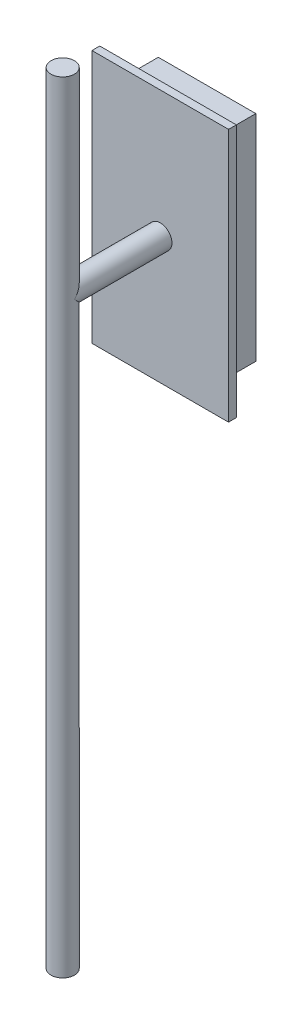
ISO-10303-21;
HEADER;
FILE_DESCRIPTION(('STEP AP214'),'2;1');
FILE_NAME('part.step','',(''),(''),'','','');
FILE_SCHEMA(('AUTOMOTIVE_DESIGN { 1 0 10303 214 1 1 1 1 }'));
ENDSEC;
DATA;
#1=APPLICATION_CONTEXT('core data for automotive mechanical design processes');
#2=APPLICATION_PROTOCOL_DEFINITION('international standard','automotive_design',2000,#1);
#3=PRODUCT_CONTEXT('',#1,'mechanical');
#4=PRODUCT('Part','Part','',(#3));
#5=PRODUCT_RELATED_PRODUCT_CATEGORY('part','',(#4));
#6=PRODUCT_DEFINITION_FORMATION('','',#4);
#7=PRODUCT_DEFINITION_CONTEXT('part definition',#1,'design');
#8=PRODUCT_DEFINITION('design','',#6,#7);
#9=PRODUCT_DEFINITION_SHAPE('','',#8);
#10=(LENGTH_UNIT() NAMED_UNIT(*) SI_UNIT(.MILLI.,.METRE.));
#11=(NAMED_UNIT(*) PLANE_ANGLE_UNIT() SI_UNIT($,.RADIAN.));
#12=(NAMED_UNIT(*) SI_UNIT($,.STERADIAN.) SOLID_ANGLE_UNIT());
#13=UNCERTAINTY_MEASURE_WITH_UNIT(LENGTH_MEASURE(1.E-05),#10,'distance_accuracy_value','');
#14=(GEOMETRIC_REPRESENTATION_CONTEXT(3) GLOBAL_UNCERTAINTY_ASSIGNED_CONTEXT((#13)) GLOBAL_UNIT_ASSIGNED_CONTEXT((#10,
#11,#12)) REPRESENTATION_CONTEXT('',''));
#15=CARTESIAN_POINT('',(0.,0.,0.));
#16=DIRECTION('',(0.,0.,1.));
#17=DIRECTION('',(1.,0.,0.));
#18=AXIS2_PLACEMENT_3D('',#15,#16,#17);
#19=CARTESIAN_POINT('',(35.,-65.,4.));
#20=DIRECTION('',(-1.,0.,0.));
#21=DIRECTION('',(0.,0.,1.));
#22=AXIS2_PLACEMENT_3D('',#19,#20,#21);
#23=PLANE('',#22);
#24=DIRECTION('',(0.,1.,0.));
#25=VECTOR('',#24,1.);
#26=CARTESIAN_POINT('',(35.,-65.,0.));
#27=LINE('',#26,#25);
#28=CARTESIAN_POINT('',(35.,-65.,0.));
#29=VERTEX_POINT('',#28);
#30=CARTESIAN_POINT('',(35.,65.,0.));
#31=VERTEX_POINT('',#30);
#32=EDGE_CURVE('E140',#29,#31,#27,.T.);
#33=ORIENTED_EDGE('',*,*,#32,.T.);
#34=DIRECTION('',(0.,0.,-1.));
#35=VECTOR('',#34,1.);
#36=CARTESIAN_POINT('',(35.,65.,4.));
#37=LINE('',#36,#35);
#38=CARTESIAN_POINT('',(35.,65.,4.));
#39=VERTEX_POINT('',#38);
#40=EDGE_CURVE('E40',#39,#31,#37,.T.);
#41=ORIENTED_EDGE('',*,*,#40,.F.);
#42=DIRECTION('',(0.,1.,0.));
#43=VECTOR('',#42,1.);
#44=CARTESIAN_POINT('',(35.,-65.,4.));
#45=LINE('',#44,#43);
#46=CARTESIAN_POINT('',(35.,-65.,4.));
#47=VERTEX_POINT('',#46);
#48=EDGE_CURVE('E141',#47,#39,#45,.T.);
#49=ORIENTED_EDGE('',*,*,#48,.F.);
#50=DIRECTION('',(0.,0.,-1.));
#51=VECTOR('',#50,1.);
#52=CARTESIAN_POINT('',(35.,-65.,4.));
#53=LINE('',#52,#51);
#54=EDGE_CURVE('E151',#47,#29,#53,.T.);
#55=ORIENTED_EDGE('',*,*,#54,.T.);
#56=EDGE_LOOP('',(#33,#41,#49,#55));
#57=FACE_BOUND('',#56,.T.);
#58=ADVANCED_FACE('F33',(#57),#23,.F.);
#59=CARTESIAN_POINT('',(-35.,65.,4.));
#60=DIRECTION('',(0.,-1.,0.));
#61=DIRECTION('',(0.,0.,-1.));
#62=AXIS2_PLACEMENT_3D('',#59,#60,#61);
#63=PLANE('',#62);
#64=DIRECTION('',(-1.,0.,0.));
#65=VECTOR('',#64,1.);
#66=CARTESIAN_POINT('',(-35.,65.,0.));
#67=LINE('',#66,#65);
#68=CARTESIAN_POINT('',(-35.,65.,0.));
#69=VERTEX_POINT('',#68);
#70=EDGE_CURVE('E154',#31,#69,#67,.T.);
#71=ORIENTED_EDGE('',*,*,#70,.T.);
#72=DIRECTION('',(0.,0.,-1.));
#73=VECTOR('',#72,1.);
#74=CARTESIAN_POINT('',(-35.,65.,4.));
#75=LINE('',#74,#73);
#76=CARTESIAN_POINT('',(-35.,65.,4.));
#77=VERTEX_POINT('',#76);
#78=EDGE_CURVE('E164',#77,#69,#75,.T.);
#79=ORIENTED_EDGE('',*,*,#78,.F.);
#80=DIRECTION('',(-1.,0.,0.));
#81=VECTOR('',#80,1.);
#82=CARTESIAN_POINT('',(-35.,65.,4.));
#83=LINE('',#82,#81);
#84=EDGE_CURVE('E144',#39,#77,#83,.T.);
#85=ORIENTED_EDGE('',*,*,#84,.F.);
#86=ORIENTED_EDGE('',*,*,#40,.T.);
#87=EDGE_LOOP('',(#71,#79,#85,#86));
#88=FACE_BOUND('',#87,.T.);
#89=ADVANCED_FACE('F169',(#88),#63,.F.);
#90=CARTESIAN_POINT('',(-35.,-65.,4.));
#91=DIRECTION('',(1.,0.,0.));
#92=DIRECTION('',(0.,0.,-1.));
#93=AXIS2_PLACEMENT_3D('',#90,#91,#92);
#94=PLANE('',#93);
#95=DIRECTION('',(0.,-1.,0.));
#96=VECTOR('',#95,1.);
#97=CARTESIAN_POINT('',(-35.,-65.,0.));
#98=LINE('',#97,#96);
#99=CARTESIAN_POINT('',(-35.,-65.,0.));
#100=VERTEX_POINT('',#99);
#101=EDGE_CURVE('E156',#69,#100,#98,.T.);
#102=ORIENTED_EDGE('',*,*,#101,.T.);
#103=DIRECTION('',(0.,0.,-1.));
#104=VECTOR('',#103,1.);
#105=CARTESIAN_POINT('',(-35.,-65.,4.));
#106=LINE('',#105,#104);
#107=CARTESIAN_POINT('',(-35.,-65.,4.));
#108=VERTEX_POINT('',#107);
#109=EDGE_CURVE('E161',#108,#100,#106,.T.);
#110=ORIENTED_EDGE('',*,*,#109,.F.);
#111=DIRECTION('',(0.,-1.,0.));
#112=VECTOR('',#111,1.);
#113=CARTESIAN_POINT('',(-35.,-65.,4.));
#114=LINE('',#113,#112);
#115=EDGE_CURVE('E147',#77,#108,#114,.T.);
#116=ORIENTED_EDGE('',*,*,#115,.F.);
#117=ORIENTED_EDGE('',*,*,#78,.T.);
#118=EDGE_LOOP('',(#102,#110,#116,#117));
#119=FACE_BOUND('',#118,.T.);
#120=ADVANCED_FACE('F181',(#119),#94,.F.);
#121=CARTESIAN_POINT('',(-35.,-65.,4.));
#122=DIRECTION('',(0.,1.,0.));
#123=DIRECTION('',(0.,0.,1.));
#124=AXIS2_PLACEMENT_3D('',#121,#122,#123);
#125=PLANE('',#124);
#126=DIRECTION('',(1.,0.,0.));
#127=VECTOR('',#126,1.);
#128=CARTESIAN_POINT('',(-35.,-65.,0.));
#129=LINE('',#128,#127);
#130=EDGE_CURVE('E145',#100,#29,#129,.T.);
#131=ORIENTED_EDGE('',*,*,#130,.T.);
#132=ORIENTED_EDGE('',*,*,#54,.F.);
#133=DIRECTION('',(1.,0.,0.));
#134=VECTOR('',#133,1.);
#135=CARTESIAN_POINT('',(-35.,-65.,4.));
#136=LINE('',#135,#134);
#137=EDGE_CURVE('E149',#108,#47,#136,.T.);
#138=ORIENTED_EDGE('',*,*,#137,.F.);
#139=ORIENTED_EDGE('',*,*,#109,.T.);
#140=EDGE_LOOP('',(#131,#132,#138,#139));
#141=FACE_BOUND('',#140,.T.);
#142=ADVANCED_FACE('F185',(#141),#125,.F.);
#143=CARTESIAN_POINT('',(0.,0.,4.));
#144=DIRECTION('',(0.,0.,-1.));
#145=DIRECTION('',(-1.,0.,0.));
#146=AXIS2_PLACEMENT_3D('',#143,#144,#145);
#147=PLANE('',#146);
#148=CARTESIAN_POINT('',(0.,0.,4.));
#149=DIRECTION('',(0.,0.,-1.));
#150=DIRECTION('',(-1.,0.,0.));
#151=AXIS2_PLACEMENT_3D('',#148,#149,#150);
#152=CIRCLE('',#151,6.);
#153=CARTESIAN_POINT('',(-6.,0.,4.));
#154=VERTEX_POINT('',#153);
#155=EDGE_CURVE('E11',#154,#154,#152,.F.);
#156=ORIENTED_EDGE('',*,*,#155,.F.);
#157=EDGE_LOOP('',(#156));
#158=FACE_BOUND('',#157,.T.);
#159=ORIENTED_EDGE('',*,*,#48,.T.);
#160=ORIENTED_EDGE('',*,*,#84,.T.);
#161=ORIENTED_EDGE('',*,*,#115,.T.);
#162=ORIENTED_EDGE('',*,*,#137,.T.);
#163=EDGE_LOOP('',(#159,#160,#161,#162));
#164=FACE_BOUND('',#163,.T.);
#165=ADVANCED_FACE('F187',(#158,#164),#147,.F.);
#166=CARTESIAN_POINT('',(0.,0.,0.));
#167=DIRECTION('',(0.,0.,-1.));
#168=DIRECTION('',(-1.,0.,0.));
#169=AXIS2_PLACEMENT_3D('',#166,#167,#168);
#170=PLANE('',#169);
#171=DIRECTION('',(1.,0.,0.));
#172=VECTOR('',#171,1.);
#173=CARTESIAN_POINT('',(-25.,55.,0.));
#174=LINE('',#173,#172);
#175=CARTESIAN_POINT('',(-25.,55.,0.));
#176=VERTEX_POINT('',#175);
#177=CARTESIAN_POINT('',(25.,55.,0.));
#178=VERTEX_POINT('',#177);
#179=EDGE_CURVE('E54',#176,#178,#174,.T.);
#180=ORIENTED_EDGE('',*,*,#179,.F.);
#181=DIRECTION('',(0.,1.,0.));
#182=VECTOR('',#181,1.);
#183=CARTESIAN_POINT('',(-25.,-55.,0.));
#184=LINE('',#183,#182);
#185=CARTESIAN_POINT('',(-25.,-55.,0.));
#186=VERTEX_POINT('',#185);
#187=EDGE_CURVE('E116',#186,#176,#184,.T.);
#188=ORIENTED_EDGE('',*,*,#187,.F.);
#189=DIRECTION('',(-1.,0.,0.));
#190=VECTOR('',#189,1.);
#191=CARTESIAN_POINT('',(25.,-55.,0.));
#192=LINE('',#191,#190);
#193=CARTESIAN_POINT('',(25.,-55.,0.));
#194=VERTEX_POINT('',#193);
#195=EDGE_CURVE('E125',#194,#186,#192,.T.);
#196=ORIENTED_EDGE('',*,*,#195,.F.);
#197=DIRECTION('',(0.,-1.,0.));
#198=VECTOR('',#197,1.);
#199=CARTESIAN_POINT('',(25.,55.,0.));
#200=LINE('',#199,#198);
#201=EDGE_CURVE('E108',#178,#194,#200,.T.);
#202=ORIENTED_EDGE('',*,*,#201,.F.);
#203=EDGE_LOOP('',(#180,#188,#196,#202));
#204=FACE_BOUND('',#203,.T.);
#205=ORIENTED_EDGE('',*,*,#32,.F.);
#206=ORIENTED_EDGE('',*,*,#130,.F.);
#207=ORIENTED_EDGE('',*,*,#101,.F.);
#208=ORIENTED_EDGE('',*,*,#70,.F.);
#209=EDGE_LOOP('',(#205,#206,#207,#208));
#210=FACE_BOUND('',#209,.T.);
#211=ADVANCED_FACE('F177',(#204,#210),#170,.T.);
#212=CARTESIAN_POINT('',(-25.,55.,-20.));
#213=DIRECTION('',(0.,-1.,0.));
#214=DIRECTION('',(0.,0.,-1.));
#215=AXIS2_PLACEMENT_3D('',#212,#213,#214);
#216=PLANE('',#215);
#217=ORIENTED_EDGE('',*,*,#179,.T.);
#218=DIRECTION('',(0.,0.,1.));
#219=VECTOR('',#218,1.);
#220=CARTESIAN_POINT('',(25.,55.,-20.));
#221=LINE('',#220,#219);
#222=CARTESIAN_POINT('',(25.,55.,-20.));
#223=VERTEX_POINT('',#222);
#224=EDGE_CURVE('E137',#223,#178,#221,.T.);
#225=ORIENTED_EDGE('',*,*,#224,.F.);
#226=DIRECTION('',(1.,0.,0.));
#227=VECTOR('',#226,1.);
#228=CARTESIAN_POINT('',(-25.,55.,-20.));
#229=LINE('',#228,#227);
#230=CARTESIAN_POINT('',(-25.,55.,-20.));
#231=VERTEX_POINT('',#230);
#232=EDGE_CURVE('E112',#231,#223,#229,.T.);
#233=ORIENTED_EDGE('',*,*,#232,.F.);
#234=DIRECTION('',(0.,0.,1.));
#235=VECTOR('',#234,1.);
#236=CARTESIAN_POINT('',(-25.,55.,-20.));
#237=LINE('',#236,#235);
#238=EDGE_CURVE('E121',#231,#176,#237,.T.);
#239=ORIENTED_EDGE('',*,*,#238,.T.);
#240=EDGE_LOOP('',(#217,#225,#233,#239));
#241=FACE_BOUND('',#240,.T.);
#242=ADVANCED_FACE('F195',(#241),#216,.F.);
#243=CARTESIAN_POINT('',(25.,55.,-20.));
#244=DIRECTION('',(-1.,0.,0.));
#245=DIRECTION('',(0.,0.,1.));
#246=AXIS2_PLACEMENT_3D('',#243,#244,#245);
#247=PLANE('',#246);
#248=ORIENTED_EDGE('',*,*,#201,.T.);
#249=DIRECTION('',(0.,0.,1.));
#250=VECTOR('',#249,1.);
#251=CARTESIAN_POINT('',(25.,-55.,-20.));
#252=LINE('',#251,#250);
#253=CARTESIAN_POINT('',(25.,-55.,-20.));
#254=VERTEX_POINT('',#253);
#255=EDGE_CURVE('E134',#254,#194,#252,.T.);
#256=ORIENTED_EDGE('',*,*,#255,.F.);
#257=DIRECTION('',(0.,-1.,0.));
#258=VECTOR('',#257,1.);
#259=CARTESIAN_POINT('',(25.,55.,-20.));
#260=LINE('',#259,#258);
#261=EDGE_CURVE('E115',#223,#254,#260,.T.);
#262=ORIENTED_EDGE('',*,*,#261,.F.);
#263=ORIENTED_EDGE('',*,*,#224,.T.);
#264=EDGE_LOOP('',(#248,#256,#262,#263));
#265=FACE_BOUND('',#264,.T.);
#266=ADVANCED_FACE('F230',(#265),#247,.F.);
#267=CARTESIAN_POINT('',(25.,-55.,-20.));
#268=DIRECTION('',(0.,1.,0.));
#269=DIRECTION('',(0.,0.,1.));
#270=AXIS2_PLACEMENT_3D('',#267,#268,#269);
#271=PLANE('',#270);
#272=ORIENTED_EDGE('',*,*,#195,.T.);
#273=DIRECTION('',(0.,0.,1.));
#274=VECTOR('',#273,1.);
#275=CARTESIAN_POINT('',(-25.,-55.,-20.));
#276=LINE('',#275,#274);
#277=CARTESIAN_POINT('',(-25.,-55.,-20.));
#278=VERTEX_POINT('',#277);
#279=EDGE_CURVE('E131',#278,#186,#276,.T.);
#280=ORIENTED_EDGE('',*,*,#279,.F.);
#281=DIRECTION('',(-1.,0.,0.));
#282=VECTOR('',#281,1.);
#283=CARTESIAN_POINT('',(25.,-55.,-20.));
#284=LINE('',#283,#282);
#285=EDGE_CURVE('E118',#254,#278,#284,.T.);
#286=ORIENTED_EDGE('',*,*,#285,.F.);
#287=ORIENTED_EDGE('',*,*,#255,.T.);
#288=EDGE_LOOP('',(#272,#280,#286,#287));
#289=FACE_BOUND('',#288,.T.);
#290=ADVANCED_FACE('F239',(#289),#271,.F.);
#291=CARTESIAN_POINT('',(-25.,-55.,-20.));
#292=DIRECTION('',(1.,0.,0.));
#293=DIRECTION('',(0.,0.,-1.));
#294=AXIS2_PLACEMENT_3D('',#291,#292,#293);
#295=PLANE('',#294);
#296=ORIENTED_EDGE('',*,*,#187,.T.);
#297=ORIENTED_EDGE('',*,*,#238,.F.);
#298=DIRECTION('',(0.,1.,0.));
#299=VECTOR('',#298,1.);
#300=CARTESIAN_POINT('',(-25.,-55.,-20.));
#301=LINE('',#300,#299);
#302=EDGE_CURVE('E120',#278,#231,#301,.T.);
#303=ORIENTED_EDGE('',*,*,#302,.F.);
#304=ORIENTED_EDGE('',*,*,#279,.T.);
#305=EDGE_LOOP('',(#296,#297,#303,#304));
#306=FACE_BOUND('',#305,.T.);
#307=ADVANCED_FACE('F249',(#306),#295,.F.);
#308=CARTESIAN_POINT('',(0.,0.,-20.));
#309=DIRECTION('',(0.,0.,-1.));
#310=DIRECTION('',(-1.,0.,0.));
#311=AXIS2_PLACEMENT_3D('',#308,#309,#310);
#312=PLANE('',#311);
#313=ORIENTED_EDGE('',*,*,#232,.T.);
#314=ORIENTED_EDGE('',*,*,#261,.T.);
#315=ORIENTED_EDGE('',*,*,#285,.T.);
#316=ORIENTED_EDGE('',*,*,#302,.T.);
#317=EDGE_LOOP('',(#313,#314,#315,#316));
#318=FACE_BOUND('',#317,.T.);
#319=ADVANCED_FACE('F259',(#318),#312,.T.);
#320=CARTESIAN_POINT('',(0.,0.,54.));
#321=DIRECTION('',(0.,0.,-1.));
#322=DIRECTION('',(-1.,0.,0.));
#323=AXIS2_PLACEMENT_3D('',#320,#321,#322);
#324=CYLINDRICAL_SURFACE('',#323,6.);
#325=CARTESIAN_POINT('',(0.,0.,54.));
#326=DIRECTION('',(0.,-0.707106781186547,-0.707106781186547));
#327=DIRECTION('',(0.,0.707106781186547,-0.707106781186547));
#328=AXIS2_PLACEMENT_3D('',#325,#326,#327);
#329=ELLIPSE('',#328,8.48528137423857,6.);
#330=CARTESIAN_POINT('',(-6.,0.,54.));
#331=VERTEX_POINT('',#330);
#332=CARTESIAN_POINT('',(6.,0.,54.));
#333=VERTEX_POINT('',#332);
#334=EDGE_CURVE('E100',#331,#333,#329,.T.);
#335=ORIENTED_EDGE('',*,*,#334,.T.);
#336=CARTESIAN_POINT('',(0.,0.,54.));
#337=DIRECTION('',(0.,0.707106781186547,-0.707106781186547));
#338=DIRECTION('',(0.,-0.707106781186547,-0.707106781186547));
#339=AXIS2_PLACEMENT_3D('',#336,#337,#338);
#340=ELLIPSE('',#339,8.48528137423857,6.);
#341=EDGE_CURVE('E46',#333,#331,#340,.T.);
#342=ORIENTED_EDGE('',*,*,#341,.T.);
#343=EDGE_LOOP('',(#335,#342));
#344=FACE_BOUND('',#343,.T.);
#345=ORIENTED_EDGE('',*,*,#155,.T.);
#346=EDGE_LOOP('',(#345));
#347=FACE_BOUND('',#346,.T.);
#348=ADVANCED_FACE('F105',(#344,#347),#324,.T.);
#349=CARTESIAN_POINT('',(0.,-300.,54.));
#350=DIRECTION('',(0.,1.,0.));
#351=DIRECTION('',(0.,0.,1.));
#352=AXIS2_PLACEMENT_3D('',#349,#350,#351);
#353=CYLINDRICAL_SURFACE('',#352,6.);
#354=CARTESIAN_POINT('',(0.,100.,54.));
#355=DIRECTION('',(0.,1.,0.));
#356=DIRECTION('',(0.,0.,1.));
#357=AXIS2_PLACEMENT_3D('',#354,#355,#356);
#358=CIRCLE('',#357,6.);
#359=CARTESIAN_POINT('',(0.,100.,60.));
#360=VERTEX_POINT('',#359);
#361=EDGE_CURVE('E315',#360,#360,#358,.T.);
#362=ORIENTED_EDGE('',*,*,#361,.F.);
#363=EDGE_LOOP('',(#362));
#364=FACE_BOUND('',#363,.T.);
#365=CARTESIAN_POINT('',(0.,-300.,54.));
#366=DIRECTION('',(0.,1.,0.));
#367=DIRECTION('',(0.,0.,1.));
#368=AXIS2_PLACEMENT_3D('',#365,#366,#367);
#369=CIRCLE('',#368,6.);
#370=CARTESIAN_POINT('',(0.,-300.,60.));
#371=VERTEX_POINT('',#370);
#372=EDGE_CURVE('E103',#371,#371,#369,.T.);
#373=ORIENTED_EDGE('',*,*,#372,.T.);
#374=EDGE_LOOP('',(#373));
#375=FACE_BOUND('',#374,.T.);
#376=ORIENTED_EDGE('',*,*,#341,.F.);
#377=ORIENTED_EDGE('',*,*,#334,.F.);
#378=EDGE_LOOP('',(#376,#377));
#379=FACE_BOUND('',#378,.T.);
#380=ADVANCED_FACE('F101',(#364,#375,#379),#353,.T.);
#381=CARTESIAN_POINT('',(0.,-300.,54.));
#382=DIRECTION('',(0.,1.,0.));
#383=DIRECTION('',(0.,0.,1.));
#384=AXIS2_PLACEMENT_3D('',#381,#382,#383);
#385=PLANE('',#384);
#386=ORIENTED_EDGE('',*,*,#372,.F.);
#387=EDGE_LOOP('',(#386));
#388=FACE_BOUND('',#387,.T.);
#389=ADVANCED_FACE('F289',(#388),#385,.F.);
#390=CARTESIAN_POINT('',(0.,100.,54.));
#391=DIRECTION('',(0.,1.,0.));
#392=DIRECTION('',(0.,0.,1.));
#393=AXIS2_PLACEMENT_3D('',#390,#391,#392);
#394=PLANE('',#393);
#395=ORIENTED_EDGE('',*,*,#361,.T.);
#396=EDGE_LOOP('',(#395));
#397=FACE_BOUND('',#396,.T.);
#398=ADVANCED_FACE('F299',(#397),#394,.T.);
#399=CLOSED_SHELL('',(#58,#89,#120,#142,#165,#211,#242,#266,#290,#307,#319,#348,#380,#389,#398));
#400=MANIFOLD_SOLID_BREP('B2',#399);
#401=ADVANCED_BREP_SHAPE_REPRESENTATION('',(#18,#400),#14);
#402=SHAPE_DEFINITION_REPRESENTATION(#9,#401);
ENDSEC;
END-ISO-10303-21;
